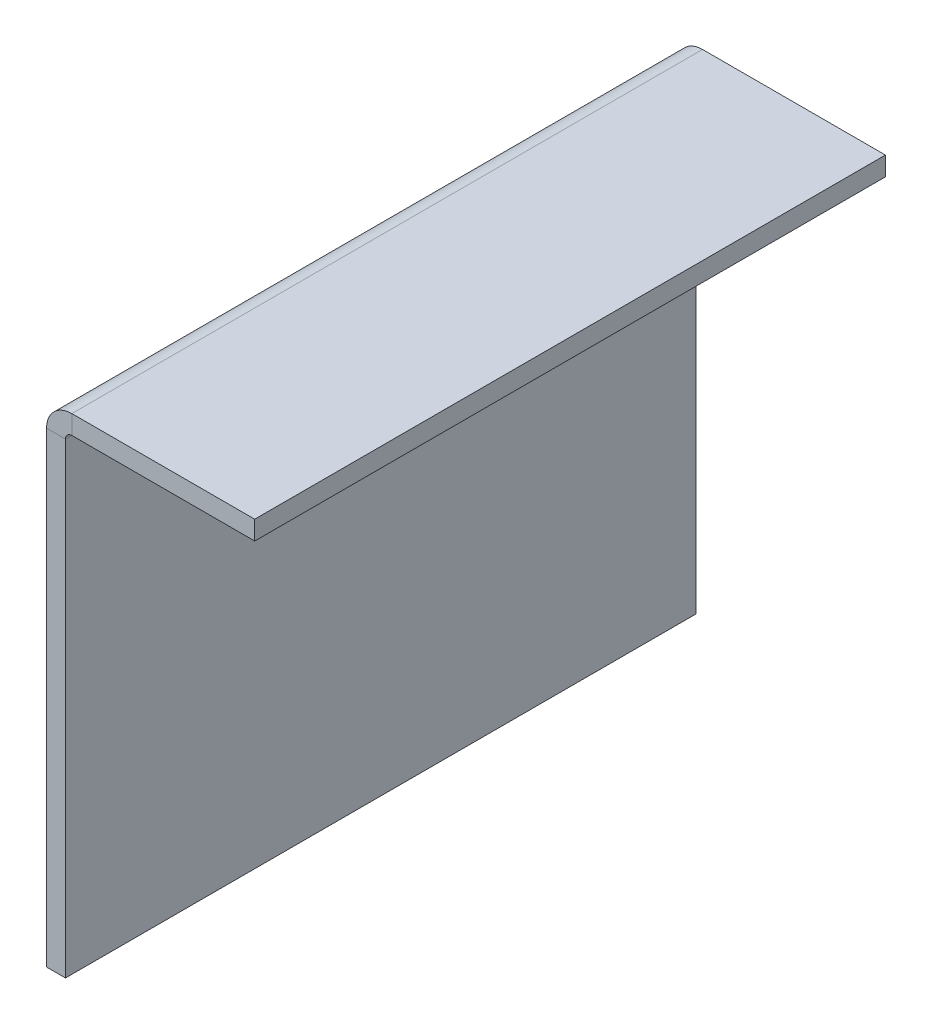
ISO-10303-21;
HEADER;
FILE_DESCRIPTION(('STEP AP214'),'2;1');
FILE_NAME('part.step','',(''),(''),'','','');
FILE_SCHEMA(('AUTOMOTIVE_DESIGN { 1 0 10303 214 1 1 1 1 }'));
ENDSEC;
DATA;
#1=APPLICATION_CONTEXT('core data for automotive mechanical design processes');
#2=APPLICATION_PROTOCOL_DEFINITION('international standard','automotive_design',2000,#1);
#3=PRODUCT_CONTEXT('',#1,'mechanical');
#4=PRODUCT('Part','Part','',(#3));
#5=PRODUCT_RELATED_PRODUCT_CATEGORY('part','',(#4));
#6=PRODUCT_DEFINITION_FORMATION('','',#4);
#7=PRODUCT_DEFINITION_CONTEXT('part definition',#1,'design');
#8=PRODUCT_DEFINITION('design','',#6,#7);
#9=PRODUCT_DEFINITION_SHAPE('','',#8);
#10=(LENGTH_UNIT() NAMED_UNIT(*) SI_UNIT(.MILLI.,.METRE.));
#11=(NAMED_UNIT(*) PLANE_ANGLE_UNIT() SI_UNIT($,.RADIAN.));
#12=(NAMED_UNIT(*) SI_UNIT($,.STERADIAN.) SOLID_ANGLE_UNIT());
#13=UNCERTAINTY_MEASURE_WITH_UNIT(LENGTH_MEASURE(1.E-05),#10,'distance_accuracy_value','');
#14=(GEOMETRIC_REPRESENTATION_CONTEXT(3) GLOBAL_UNCERTAINTY_ASSIGNED_CONTEXT((#13)) GLOBAL_UNIT_ASSIGNED_CONTEXT((#10,
#11,#12)) REPRESENTATION_CONTEXT('',''));
#15=CARTESIAN_POINT('',(0.,0.,0.));
#16=DIRECTION('',(0.,0.,1.));
#17=DIRECTION('',(1.,0.,0.));
#18=AXIS2_PLACEMENT_3D('',#15,#16,#17);
#19=CARTESIAN_POINT('',(3.,0.,100.));
#20=DIRECTION('',(-1.,0.,0.));
#21=DIRECTION('',(0.,0.,1.));
#22=AXIS2_PLACEMENT_3D('',#19,#20,#21);
#23=PLANE('',#22);
#24=DIRECTION('',(0.,1.,0.));
#25=VECTOR('',#24,1.);
#26=CARTESIAN_POINT('',(3.,0.,0.));
#27=LINE('',#26,#25);
#28=CARTESIAN_POINT('',(3.,0.,0.));
#29=VERTEX_POINT('',#28);
#30=CARTESIAN_POINT('',(3.,74.,0.));
#31=VERTEX_POINT('',#30);
#32=EDGE_CURVE('E179',#29,#31,#27,.T.);
#33=ORIENTED_EDGE('',*,*,#32,.T.);
#34=DIRECTION('',(0.,0.,1.));
#35=VECTOR('',#34,1.);
#36=CARTESIAN_POINT('',(3.,74.,100.));
#37=LINE('',#36,#35);
#38=CARTESIAN_POINT('',(3.,74.,100.));
#39=VERTEX_POINT('',#38);
#40=EDGE_CURVE('E162',#39,#31,#37,.F.);
#41=ORIENTED_EDGE('',*,*,#40,.F.);
#42=DIRECTION('',(0.,1.,0.));
#43=VECTOR('',#42,1.);
#44=CARTESIAN_POINT('',(3.,0.,100.));
#45=LINE('',#44,#43);
#46=CARTESIAN_POINT('',(3.,0.,100.));
#47=VERTEX_POINT('',#46);
#48=EDGE_CURVE('E190',#47,#39,#45,.T.);
#49=ORIENTED_EDGE('',*,*,#48,.F.);
#50=DIRECTION('',(0.,0.,-1.));
#51=VECTOR('',#50,1.);
#52=CARTESIAN_POINT('',(3.,0.,100.));
#53=LINE('',#52,#51);
#54=EDGE_CURVE('E60',#47,#29,#53,.T.);
#55=ORIENTED_EDGE('',*,*,#54,.T.);
#56=EDGE_LOOP('',(#33,#41,#49,#55));
#57=FACE_BOUND('',#56,.T.);
#58=ADVANCED_FACE('F53',(#57),#23,.F.);
#59=CARTESIAN_POINT('',(0.,0.,100.));
#60=DIRECTION('',(-1.,0.,0.));
#61=DIRECTION('',(0.,0.,1.));
#62=AXIS2_PLACEMENT_3D('',#59,#60,#61);
#63=PLANE('',#62);
#64=DIRECTION('',(0.,1.,0.));
#65=VECTOR('',#64,1.);
#66=CARTESIAN_POINT('',(0.,0.,0.));
#67=LINE('',#66,#65);
#68=CARTESIAN_POINT('',(0.,0.,0.));
#69=VERTEX_POINT('',#68);
#70=CARTESIAN_POINT('',(0.,74.,0.));
#71=VERTEX_POINT('',#70);
#72=EDGE_CURVE('E184',#69,#71,#67,.T.);
#73=ORIENTED_EDGE('',*,*,#72,.F.);
#74=DIRECTION('',(0.,0.,-1.));
#75=VECTOR('',#74,1.);
#76=CARTESIAN_POINT('',(0.,0.,100.));
#77=LINE('',#76,#75);
#78=CARTESIAN_POINT('',(0.,0.,100.));
#79=VERTEX_POINT('',#78);
#80=EDGE_CURVE('E13',#79,#69,#77,.T.);
#81=ORIENTED_EDGE('',*,*,#80,.F.);
#82=DIRECTION('',(0.,1.,0.));
#83=VECTOR('',#82,1.);
#84=CARTESIAN_POINT('',(0.,0.,100.));
#85=LINE('',#84,#83);
#86=CARTESIAN_POINT('',(0.,74.,100.));
#87=VERTEX_POINT('',#86);
#88=EDGE_CURVE('E193',#79,#87,#85,.T.);
#89=ORIENTED_EDGE('',*,*,#88,.T.);
#90=DIRECTION('',(0.,0.,1.));
#91=VECTOR('',#90,1.);
#92=CARTESIAN_POINT('',(0.,74.,100.));
#93=LINE('',#92,#91);
#94=EDGE_CURVE('E167',#87,#71,#93,.F.);
#95=ORIENTED_EDGE('',*,*,#94,.T.);
#96=EDGE_LOOP('',(#73,#81,#89,#95));
#97=FACE_BOUND('',#96,.T.);
#98=ADVANCED_FACE('F204',(#97),#63,.T.);
#99=CARTESIAN_POINT('',(3.,0.,100.));
#100=DIRECTION('',(0.,-1.,0.));
#101=DIRECTION('',(0.,0.,-1.));
#102=AXIS2_PLACEMENT_3D('',#99,#100,#101);
#103=PLANE('',#102);
#104=DIRECTION('',(-1.,0.,0.));
#105=VECTOR('',#104,1.);
#106=CARTESIAN_POINT('',(3.,0.,0.));
#107=LINE('',#106,#105);
#108=EDGE_CURVE('E187',#29,#69,#107,.T.);
#109=ORIENTED_EDGE('',*,*,#108,.F.);
#110=ORIENTED_EDGE('',*,*,#54,.F.);
#111=DIRECTION('',(-1.,0.,0.));
#112=VECTOR('',#111,1.);
#113=CARTESIAN_POINT('',(3.,0.,100.));
#114=LINE('',#113,#112);
#115=EDGE_CURVE('E195',#47,#79,#114,.T.);
#116=ORIENTED_EDGE('',*,*,#115,.T.);
#117=ORIENTED_EDGE('',*,*,#80,.T.);
#118=EDGE_LOOP('',(#109,#110,#116,#117));
#119=FACE_BOUND('',#118,.T.);
#120=ADVANCED_FACE('F203',(#119),#103,.T.);
#121=CARTESIAN_POINT('',(3.,60.,100.));
#122=DIRECTION('',(0.,0.,-1.));
#123=DIRECTION('',(-1.,0.,0.));
#124=AXIS2_PLACEMENT_3D('',#121,#122,#123);
#125=PLANE('',#124);
#126=ORIENTED_EDGE('',*,*,#48,.T.);
#127=DIRECTION('',(-1.,0.,0.));
#128=VECTOR('',#127,1.);
#129=CARTESIAN_POINT('',(3.,74.,100.));
#130=LINE('',#129,#128);
#131=EDGE_CURVE('E173',#39,#87,#130,.T.);
#132=ORIENTED_EDGE('',*,*,#131,.T.);
#133=ORIENTED_EDGE('',*,*,#88,.F.);
#134=ORIENTED_EDGE('',*,*,#115,.F.);
#135=EDGE_LOOP('',(#126,#132,#133,#134));
#136=FACE_BOUND('',#135,.T.);
#137=ADVANCED_FACE('F229',(#136),#125,.F.);
#138=CARTESIAN_POINT('',(3.,60.,0.));
#139=DIRECTION('',(0.,0.,-1.));
#140=DIRECTION('',(-1.,0.,0.));
#141=AXIS2_PLACEMENT_3D('',#138,#139,#140);
#142=PLANE('',#141);
#143=ORIENTED_EDGE('',*,*,#32,.F.);
#144=ORIENTED_EDGE('',*,*,#108,.T.);
#145=ORIENTED_EDGE('',*,*,#72,.T.);
#146=DIRECTION('',(-1.,0.,0.));
#147=VECTOR('',#146,1.);
#148=CARTESIAN_POINT('',(3.,74.,0.));
#149=LINE('',#148,#147);
#150=EDGE_CURVE('E176',#31,#71,#149,.T.);
#151=ORIENTED_EDGE('',*,*,#150,.F.);
#152=EDGE_LOOP('',(#143,#144,#145,#151));
#153=FACE_BOUND('',#152,.T.);
#154=ADVANCED_FACE('F202',(#153),#142,.T.);
#155=CARTESIAN_POINT('',(4.,74.,0.));
#156=DIRECTION('',(0.,0.,-1.));
#157=DIRECTION('',(-1.,0.,0.));
#158=AXIS2_PLACEMENT_3D('',#155,#156,#157);
#159=PLANE('',#158);
#160=DIRECTION('',(0.,-1.,0.));
#161=VECTOR('',#160,1.);
#162=CARTESIAN_POINT('',(3.99999999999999,78.,0.));
#163=LINE('',#162,#161);
#164=CARTESIAN_POINT('',(3.99999999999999,75.,0.));
#165=VERTEX_POINT('',#164);
#166=CARTESIAN_POINT('',(3.99999999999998,78.,0.));
#167=VERTEX_POINT('',#166);
#168=EDGE_CURVE('E140',#165,#167,#163,.F.);
#169=ORIENTED_EDGE('',*,*,#168,.F.);
#170=CARTESIAN_POINT('',(4.,74.,0.));
#171=DIRECTION('',(0.,0.,1.));
#172=DIRECTION('',(1.,0.,0.));
#173=AXIS2_PLACEMENT_3D('',#170,#171,#172);
#174=CIRCLE('',#173,1.);
#175=EDGE_CURVE('E158',#31,#165,#174,.F.);
#176=ORIENTED_EDGE('',*,*,#175,.F.);
#177=ORIENTED_EDGE('',*,*,#150,.T.);
#178=CARTESIAN_POINT('',(4.,74.,0.));
#179=DIRECTION('',(0.,0.,1.));
#180=DIRECTION('',(1.,0.,0.));
#181=AXIS2_PLACEMENT_3D('',#178,#179,#180);
#182=CIRCLE('',#181,4.);
#183=EDGE_CURVE('E170',#71,#167,#182,.F.);
#184=ORIENTED_EDGE('',*,*,#183,.T.);
#185=EDGE_LOOP('',(#169,#176,#177,#184));
#186=FACE_BOUND('',#185,.T.);
#187=ADVANCED_FACE('F221',(#186),#159,.T.);
#188=CARTESIAN_POINT('',(4.,74.,100.));
#189=DIRECTION('',(0.,0.,-1.));
#190=DIRECTION('',(-1.,0.,0.));
#191=AXIS2_PLACEMENT_3D('',#188,#189,#190);
#192=PLANE('',#191);
#193=CARTESIAN_POINT('',(4.,74.,100.));
#194=DIRECTION('',(0.,0.,1.));
#195=DIRECTION('',(1.,0.,0.));
#196=AXIS2_PLACEMENT_3D('',#193,#194,#195);
#197=CIRCLE('',#196,1.);
#198=CARTESIAN_POINT('',(3.99999999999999,75.,100.));
#199=VERTEX_POINT('',#198);
#200=EDGE_CURVE('E164',#199,#39,#197,.T.);
#201=ORIENTED_EDGE('',*,*,#200,.F.);
#202=DIRECTION('',(0.,-1.,0.));
#203=VECTOR('',#202,1.);
#204=CARTESIAN_POINT('',(3.99999999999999,75.,100.));
#205=LINE('',#204,#203);
#206=CARTESIAN_POINT('',(3.99999999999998,78.,100.));
#207=VERTEX_POINT('',#206);
#208=EDGE_CURVE('E152',#199,#207,#205,.F.);
#209=ORIENTED_EDGE('',*,*,#208,.T.);
#210=CARTESIAN_POINT('',(4.,74.,100.));
#211=DIRECTION('',(0.,0.,1.));
#212=DIRECTION('',(1.,0.,0.));
#213=AXIS2_PLACEMENT_3D('',#210,#211,#212);
#214=CIRCLE('',#213,4.);
#215=EDGE_CURVE('E161',#207,#87,#214,.T.);
#216=ORIENTED_EDGE('',*,*,#215,.T.);
#217=ORIENTED_EDGE('',*,*,#131,.F.);
#218=EDGE_LOOP('',(#201,#209,#216,#217));
#219=FACE_BOUND('',#218,.T.);
#220=ADVANCED_FACE('F209',(#219),#192,.F.);
#221=CARTESIAN_POINT('',(4.,74.,100.));
#222=DIRECTION('',(0.,0.,1.));
#223=DIRECTION('',(0.,1.,0.));
#224=AXIS2_PLACEMENT_3D('',#221,#222,#223);
#225=CYLINDRICAL_SURFACE('',#224,4.);
#226=ORIENTED_EDGE('',*,*,#94,.F.);
#227=ORIENTED_EDGE('',*,*,#215,.F.);
#228=DIRECTION('',(0.,0.,1.));
#229=VECTOR('',#228,1.);
#230=CARTESIAN_POINT('',(3.99999999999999,78.,0.));
#231=LINE('',#230,#229);
#232=EDGE_CURVE('E150',#207,#167,#231,.F.);
#233=ORIENTED_EDGE('',*,*,#232,.T.);
#234=ORIENTED_EDGE('',*,*,#183,.F.);
#235=EDGE_LOOP('',(#226,#227,#233,#234));
#236=FACE_BOUND('',#235,.T.);
#237=ADVANCED_FACE('F206',(#236),#225,.T.);
#238=CARTESIAN_POINT('',(4.,74.,100.));
#239=DIRECTION('',(0.,0.,1.));
#240=DIRECTION('',(0.,1.,0.));
#241=AXIS2_PLACEMENT_3D('',#238,#239,#240);
#242=CYLINDRICAL_SURFACE('',#241,1.);
#243=ORIENTED_EDGE('',*,*,#40,.T.);
#244=ORIENTED_EDGE('',*,*,#175,.T.);
#245=DIRECTION('',(0.,0.,1.));
#246=VECTOR('',#245,1.);
#247=CARTESIAN_POINT('',(4.,75.,0.));
#248=LINE('',#247,#246);
#249=EDGE_CURVE('E155',#165,#199,#248,.T.);
#250=ORIENTED_EDGE('',*,*,#249,.T.);
#251=ORIENTED_EDGE('',*,*,#200,.T.);
#252=EDGE_LOOP('',(#243,#244,#250,#251));
#253=FACE_BOUND('',#252,.T.);
#254=ADVANCED_FACE('F218',(#253),#242,.F.);
#255=CARTESIAN_POINT('',(33.,78.0000000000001,100.));
#256=DIRECTION('',(0.,0.,-1.));
#257=DIRECTION('',(-1.,0.,0.));
#258=AXIS2_PLACEMENT_3D('',#255,#256,#257);
#259=PLANE('',#258);
#260=ORIENTED_EDGE('',*,*,#208,.F.);
#261=DIRECTION('',(-1.,0.,0.));
#262=VECTOR('',#261,1.);
#263=CARTESIAN_POINT('',(33.,75.0000000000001,100.));
#264=LINE('',#263,#262);
#265=CARTESIAN_POINT('',(33.,75.0000000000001,100.));
#266=VERTEX_POINT('',#265);
#267=EDGE_CURVE('E148',#199,#266,#264,.F.);
#268=ORIENTED_EDGE('',*,*,#267,.T.);
#269=DIRECTION('',(0.,-1.,0.));
#270=VECTOR('',#269,1.);
#271=CARTESIAN_POINT('',(33.,78.0000000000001,100.));
#272=LINE('',#271,#270);
#273=CARTESIAN_POINT('',(33.,78.0000000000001,100.));
#274=VERTEX_POINT('',#273);
#275=EDGE_CURVE('E136',#274,#266,#272,.T.);
#276=ORIENTED_EDGE('',*,*,#275,.F.);
#277=DIRECTION('',(1.,0.,0.));
#278=VECTOR('',#277,1.);
#279=CARTESIAN_POINT('',(2.99999999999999,78.,100.));
#280=LINE('',#279,#278);
#281=EDGE_CURVE('E123',#207,#274,#280,.T.);
#282=ORIENTED_EDGE('',*,*,#281,.F.);
#283=EDGE_LOOP('',(#260,#268,#276,#282));
#284=FACE_BOUND('',#283,.T.);
#285=ADVANCED_FACE('F213',(#284),#259,.F.);
#286=CARTESIAN_POINT('',(2.99999999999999,78.,0.));
#287=DIRECTION('',(0.,0.,1.));
#288=DIRECTION('',(1.,0.,0.));
#289=AXIS2_PLACEMENT_3D('',#286,#287,#288);
#290=PLANE('',#289);
#291=ORIENTED_EDGE('',*,*,#168,.T.);
#292=DIRECTION('',(-1.,0.,0.));
#293=VECTOR('',#292,1.);
#294=CARTESIAN_POINT('',(2.99999999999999,78.,0.));
#295=LINE('',#294,#293);
#296=CARTESIAN_POINT('',(33.,78.0000000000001,0.));
#297=VERTEX_POINT('',#296);
#298=EDGE_CURVE('E121',#297,#167,#295,.T.);
#299=ORIENTED_EDGE('',*,*,#298,.F.);
#300=DIRECTION('',(0.,-1.,0.));
#301=VECTOR('',#300,1.);
#302=CARTESIAN_POINT('',(33.,78.0000000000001,0.));
#303=LINE('',#302,#301);
#304=CARTESIAN_POINT('',(33.,75.0000000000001,0.));
#305=VERTEX_POINT('',#304);
#306=EDGE_CURVE('E129',#297,#305,#303,.T.);
#307=ORIENTED_EDGE('',*,*,#306,.T.);
#308=DIRECTION('',(1.,0.,0.));
#309=VECTOR('',#308,1.);
#310=CARTESIAN_POINT('',(3.,75.,0.));
#311=LINE('',#310,#309);
#312=EDGE_CURVE('E145',#305,#165,#311,.F.);
#313=ORIENTED_EDGE('',*,*,#312,.T.);
#314=EDGE_LOOP('',(#291,#299,#307,#313));
#315=FACE_BOUND('',#314,.T.);
#316=ADVANCED_FACE('F139',(#315),#290,.F.);
#317=CARTESIAN_POINT('',(2.99999999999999,78.,0.));
#318=DIRECTION('',(0.,-1.,0.));
#319=DIRECTION('',(1.,0.,0.));
#320=AXIS2_PLACEMENT_3D('',#317,#318,#319);
#321=PLANE('',#320);
#322=ORIENTED_EDGE('',*,*,#232,.F.);
#323=ORIENTED_EDGE('',*,*,#281,.T.);
#324=DIRECTION('',(0.,0.,-1.));
#325=VECTOR('',#324,1.);
#326=CARTESIAN_POINT('',(33.,78.0000000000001,0.));
#327=LINE('',#326,#325);
#328=EDGE_CURVE('E116',#274,#297,#327,.T.);
#329=ORIENTED_EDGE('',*,*,#328,.T.);
#330=ORIENTED_EDGE('',*,*,#298,.T.);
#331=EDGE_LOOP('',(#322,#323,#329,#330));
#332=FACE_BOUND('',#331,.T.);
#333=ADVANCED_FACE('F119',(#332),#321,.F.);
#334=CARTESIAN_POINT('',(3.,75.,0.));
#335=DIRECTION('',(0.,-1.,0.));
#336=DIRECTION('',(1.,0.,0.));
#337=AXIS2_PLACEMENT_3D('',#334,#335,#336);
#338=PLANE('',#337);
#339=ORIENTED_EDGE('',*,*,#267,.F.);
#340=ORIENTED_EDGE('',*,*,#249,.F.);
#341=ORIENTED_EDGE('',*,*,#312,.F.);
#342=DIRECTION('',(0.,0.,1.));
#343=VECTOR('',#342,1.);
#344=CARTESIAN_POINT('',(33.,75.0000000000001,0.));
#345=LINE('',#344,#343);
#346=EDGE_CURVE('E132',#266,#305,#345,.F.);
#347=ORIENTED_EDGE('',*,*,#346,.F.);
#348=EDGE_LOOP('',(#339,#340,#341,#347));
#349=FACE_BOUND('',#348,.T.);
#350=ADVANCED_FACE('F215',(#349),#338,.T.);
#351=CARTESIAN_POINT('',(33.,78.0000000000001,0.));
#352=DIRECTION('',(-1.,0.,0.));
#353=DIRECTION('',(0.,-1.,0.));
#354=AXIS2_PLACEMENT_3D('',#351,#352,#353);
#355=PLANE('',#354);
#356=ORIENTED_EDGE('',*,*,#346,.T.);
#357=ORIENTED_EDGE('',*,*,#306,.F.);
#358=ORIENTED_EDGE('',*,*,#328,.F.);
#359=ORIENTED_EDGE('',*,*,#275,.T.);
#360=EDGE_LOOP('',(#356,#357,#358,#359));
#361=FACE_BOUND('',#360,.T.);
#362=ADVANCED_FACE('F130',(#361),#355,.F.);
#363=CLOSED_SHELL('',(#58,#98,#120,#137,#154,#187,#220,#237,#254,#285,#316,#333,#350,#362));
#364=MANIFOLD_SOLID_BREP('B2',#363);
#365=ADVANCED_BREP_SHAPE_REPRESENTATION('',(#18,#364),#14);
#366=SHAPE_DEFINITION_REPRESENTATION(#9,#365);
ENDSEC;
END-ISO-10303-21;
